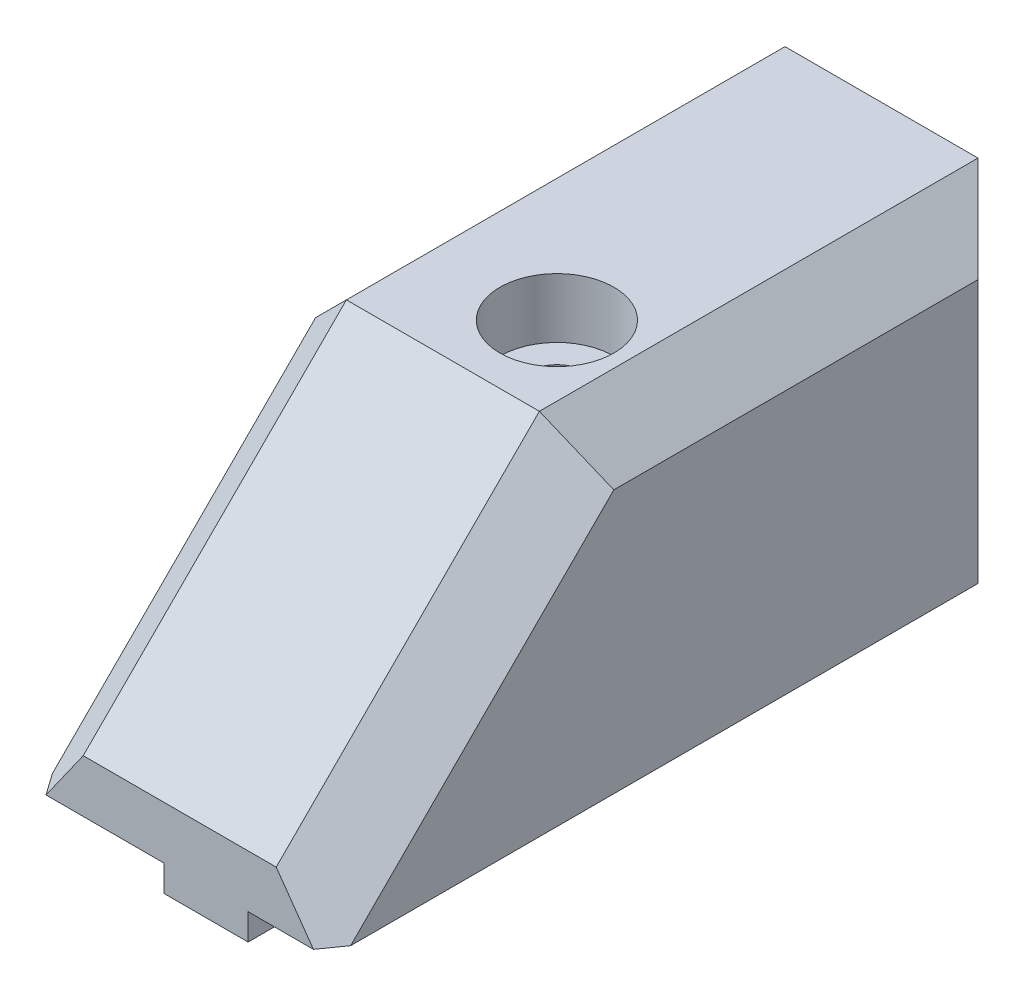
ISO-10303-21;
HEADER;
FILE_DESCRIPTION(('STEP AP214'),'2;1');
FILE_NAME('part.step','',(''),(''),'','','');
FILE_SCHEMA(('AUTOMOTIVE_DESIGN { 1 0 10303 214 1 1 1 1 }'));
ENDSEC;
DATA;
#1=APPLICATION_CONTEXT('core data for automotive mechanical design processes');
#2=APPLICATION_PROTOCOL_DEFINITION('international standard','automotive_design',2000,#1);
#3=PRODUCT_CONTEXT('',#1,'mechanical');
#4=PRODUCT('Part','Part','',(#3));
#5=PRODUCT_RELATED_PRODUCT_CATEGORY('part','',(#4));
#6=PRODUCT_DEFINITION_FORMATION('','',#4);
#7=PRODUCT_DEFINITION_CONTEXT('part definition',#1,'design');
#8=PRODUCT_DEFINITION('design','',#6,#7);
#9=PRODUCT_DEFINITION_SHAPE('','',#8);
#10=(LENGTH_UNIT() NAMED_UNIT(*) SI_UNIT(.MILLI.,.METRE.));
#11=(NAMED_UNIT(*) PLANE_ANGLE_UNIT() SI_UNIT($,.RADIAN.));
#12=(NAMED_UNIT(*) SI_UNIT($,.STERADIAN.) SOLID_ANGLE_UNIT());
#13=UNCERTAINTY_MEASURE_WITH_UNIT(LENGTH_MEASURE(1.E-05),#10,'distance_accuracy_value','');
#14=(GEOMETRIC_REPRESENTATION_CONTEXT(3) GLOBAL_UNCERTAINTY_ASSIGNED_CONTEXT((#13)) GLOBAL_UNIT_ASSIGNED_CONTEXT((#10,
#11,#12)) REPRESENTATION_CONTEXT('',''));
#15=CARTESIAN_POINT('',(0.,0.,0.));
#16=DIRECTION('',(0.,0.,1.));
#17=DIRECTION('',(1.,0.,0.));
#18=AXIS2_PLACEMENT_3D('',#15,#16,#17);
#19=CARTESIAN_POINT('',(17.,0.,0.));
#20=DIRECTION('',(0.,-1.,0.));
#21=DIRECTION('',(0.,0.,-1.));
#22=AXIS2_PLACEMENT_3D('',#19,#20,#21);
#23=PLANE('',#22);
#24=DIRECTION('',(0.,0.,1.));
#25=VECTOR('',#24,1.);
#26=CARTESIAN_POINT('',(25.5,0.,20.));
#27=LINE('',#26,#25);
#28=CARTESIAN_POINT('',(25.5,0.,-17.));
#29=VERTEX_POINT('',#28);
#30=CARTESIAN_POINT('',(25.5,0.,18.7573593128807));
#31=VERTEX_POINT('',#30);
#32=EDGE_CURVE('E189',#29,#31,#27,.T.);
#33=ORIENTED_EDGE('',*,*,#32,.T.);
#34=DIRECTION('',(-0.577350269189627,0.,0.816496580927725));
#35=VECTOR('',#34,1.);
#36=CARTESIAN_POINT('',(31.5089706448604,0.,10.2593915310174));
#37=LINE('',#36,#35);
#38=CARTESIAN_POINT('',(24.6213203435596,0.,20.));
#39=VERTEX_POINT('',#38);
#40=EDGE_CURVE('E207',#39,#31,#37,.F.);
#41=ORIENTED_EDGE('',*,*,#40,.F.);
#42=DIRECTION('',(-1.,0.,0.));
#43=VECTOR('',#42,1.);
#44=CARTESIAN_POINT('',(25.5,0.,20.));
#45=LINE('',#44,#43);
#46=CARTESIAN_POINT('',(20.9,0.,20.));
#47=VERTEX_POINT('',#46);
#48=EDGE_CURVE('E183',#39,#47,#45,.T.);
#49=ORIENTED_EDGE('',*,*,#48,.T.);
#50=DIRECTION('',(0.,0.,-1.));
#51=VECTOR('',#50,1.);
#52=CARTESIAN_POINT('',(20.9,0.,20.));
#53=LINE('',#52,#51);
#54=CARTESIAN_POINT('',(20.9,0.,-20.));
#55=VERTEX_POINT('',#54);
#56=EDGE_CURVE('E305',#47,#55,#53,.T.);
#57=ORIENTED_EDGE('',*,*,#56,.T.);
#58=DIRECTION('',(1.,0.,0.));
#59=VECTOR('',#58,1.);
#60=CARTESIAN_POINT('',(25.5,0.,-20.));
#61=LINE('',#60,#59);
#62=CARTESIAN_POINT('',(22.5,0.,-20.));
#63=VERTEX_POINT('',#62);
#64=EDGE_CURVE('E164',#55,#63,#61,.T.);
#65=ORIENTED_EDGE('',*,*,#64,.T.);
#66=DIRECTION('',(0.707106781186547,0.,0.707106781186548));
#67=VECTOR('',#66,1.);
#68=CARTESIAN_POINT('',(29.75,0.,-12.75));
#69=LINE('',#68,#67);
#70=EDGE_CURVE('E211',#29,#63,#69,.F.);
#71=ORIENTED_EDGE('',*,*,#70,.F.);
#72=EDGE_LOOP('',(#33,#41,#49,#57,#65,#71));
#73=FACE_BOUND('',#72,.T.);
#74=ADVANCED_FACE('F43',(#73),#23,.T.);
#75=CARTESIAN_POINT('',(8.5,18.,20.));
#76=DIRECTION('',(1.,0.,0.));
#77=DIRECTION('',(0.,0.,1.));
#78=AXIS2_PLACEMENT_3D('',#75,#76,#77);
#79=PLANE('',#78);
#80=DIRECTION('',(0.,0.,-1.));
#81=VECTOR('',#80,1.);
#82=CARTESIAN_POINT('',(8.5,0.,20.));
#83=LINE('',#82,#81);
#84=CARTESIAN_POINT('',(8.5,0.,18.7573593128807));
#85=VERTEX_POINT('',#84);
#86=CARTESIAN_POINT('',(8.5,0.,-17.));
#87=VERTEX_POINT('',#86);
#88=EDGE_CURVE('E167',#85,#87,#83,.T.);
#89=ORIENTED_EDGE('',*,*,#88,.F.);
#90=DIRECTION('',(0.,-0.707106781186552,0.707106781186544));
#91=VECTOR('',#90,1.);
#92=CARTESIAN_POINT('',(8.5,8.37867965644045,10.3786796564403));
#93=LINE('',#92,#91);
#94=CARTESIAN_POINT('',(8.5,15.,3.75735931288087));
#95=VERTEX_POINT('',#94);
#96=EDGE_CURVE('E53',#95,#85,#93,.T.);
#97=ORIENTED_EDGE('',*,*,#96,.F.);
#98=DIRECTION('',(0.,0.,1.));
#99=VECTOR('',#98,1.);
#100=CARTESIAN_POINT('',(8.5,15.,20.));
#101=LINE('',#100,#99);
#102=CARTESIAN_POINT('',(8.5,15.,-17.));
#103=VERTEX_POINT('',#102);
#104=EDGE_CURVE('E249',#103,#95,#101,.T.);
#105=ORIENTED_EDGE('',*,*,#104,.F.);
#106=DIRECTION('',(0.,1.,0.));
#107=VECTOR('',#106,1.);
#108=CARTESIAN_POINT('',(8.5,18.,-17.));
#109=LINE('',#108,#107);
#110=EDGE_CURVE('E11',#87,#103,#109,.T.);
#111=ORIENTED_EDGE('',*,*,#110,.F.);
#112=EDGE_LOOP('',(#89,#97,#105,#111));
#113=FACE_BOUND('',#112,.T.);
#114=ADVANCED_FACE('F363',(#113),#79,.F.);
#115=CARTESIAN_POINT('',(25.5,18.,-20.));
#116=DIRECTION('',(0.,0.,1.));
#117=DIRECTION('',(-1.,0.,0.));
#118=AXIS2_PLACEMENT_3D('',#115,#116,#117);
#119=PLANE('',#118);
#120=CARTESIAN_POINT('',(18.5,12.,-20.));
#121=DIRECTION('',(0.,0.,1.));
#122=DIRECTION('',(1.,0.,0.));
#123=AXIS2_PLACEMENT_3D('',#120,#121,#122);
#124=CIRCLE('',#123,2.8);
#125=CARTESIAN_POINT('',(21.3,12.,-20.));
#126=VERTEX_POINT('',#125);
#127=EDGE_CURVE('E275',#126,#126,#124,.T.);
#128=ORIENTED_EDGE('',*,*,#127,.T.);
#129=EDGE_LOOP('',(#128));
#130=FACE_BOUND('',#129,.T.);
#131=ORIENTED_EDGE('',*,*,#64,.F.);
#132=DIRECTION('',(0.,1.,0.));
#133=VECTOR('',#132,1.);
#134=CARTESIAN_POINT('',(20.9,-1.5,-20.));
#135=LINE('',#134,#133);
#136=CARTESIAN_POINT('',(20.9,-1.5,-20.));
#137=VERTEX_POINT('',#136);
#138=EDGE_CURVE('E144',#137,#55,#135,.T.);
#139=ORIENTED_EDGE('',*,*,#138,.F.);
#140=DIRECTION('',(-1.,0.,0.));
#141=VECTOR('',#140,1.);
#142=CARTESIAN_POINT('',(20.9,-1.5,-20.));
#143=LINE('',#142,#141);
#144=CARTESIAN_POINT('',(16.1,-1.5,-20.));
#145=VERTEX_POINT('',#144);
#146=EDGE_CURVE('E151',#137,#145,#143,.T.);
#147=ORIENTED_EDGE('',*,*,#146,.T.);
#148=DIRECTION('',(0.,1.,0.));
#149=VECTOR('',#148,1.);
#150=CARTESIAN_POINT('',(16.1,-1.5,-20.));
#151=LINE('',#150,#149);
#152=CARTESIAN_POINT('',(16.1,0.,-20.));
#153=VERTEX_POINT('',#152);
#154=EDGE_CURVE('E168',#145,#153,#151,.T.);
#155=ORIENTED_EDGE('',*,*,#154,.T.);
#156=CARTESIAN_POINT('',(11.5,0.,-20.));
#157=VERTEX_POINT('',#156);
#158=EDGE_CURVE('E185',#157,#153,#61,.T.);
#159=ORIENTED_EDGE('',*,*,#158,.F.);
#160=DIRECTION('',(0.,-1.,0.));
#161=VECTOR('',#160,1.);
#162=CARTESIAN_POINT('',(11.5,18.,-20.));
#163=LINE('',#162,#161);
#164=CARTESIAN_POINT('',(11.5,18.,-20.));
#165=VERTEX_POINT('',#164);
#166=EDGE_CURVE('E215',#165,#157,#163,.T.);
#167=ORIENTED_EDGE('',*,*,#166,.F.);
#168=DIRECTION('',(1.,0.,0.));
#169=VECTOR('',#168,1.);
#170=CARTESIAN_POINT('',(25.5,18.,-20.));
#171=LINE('',#170,#169);
#172=CARTESIAN_POINT('',(22.5,18.,-20.));
#173=VERTEX_POINT('',#172);
#174=EDGE_CURVE('E179',#165,#173,#171,.T.);
#175=ORIENTED_EDGE('',*,*,#174,.T.);
#176=DIRECTION('',(0.,1.,0.));
#177=VECTOR('',#176,1.);
#178=CARTESIAN_POINT('',(22.5,18.,-20.));
#179=LINE('',#178,#177);
#180=EDGE_CURVE('E219',#63,#173,#179,.T.);
#181=ORIENTED_EDGE('',*,*,#180,.F.);
#182=EDGE_LOOP('',(#131,#139,#147,#155,#159,#167,#175,#181));
#183=FACE_BOUND('',#182,.T.);
#184=ADVANCED_FACE('F162',(#130,#183),#119,.F.);
#185=CARTESIAN_POINT('',(25.5,18.,20.));
#186=DIRECTION('',(-1.,0.,0.));
#187=DIRECTION('',(0.,0.,-1.));
#188=AXIS2_PLACEMENT_3D('',#185,#186,#187);
#189=PLANE('',#188);
#190=DIRECTION('',(0.,0.,-1.));
#191=VECTOR('',#190,1.);
#192=CARTESIAN_POINT('',(25.5,15.,20.));
#193=LINE('',#192,#191);
#194=CARTESIAN_POINT('',(25.5,15.,3.75735931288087));
#195=VERTEX_POINT('',#194);
#196=CARTESIAN_POINT('',(25.5,15.,-17.));
#197=VERTEX_POINT('',#196);
#198=EDGE_CURVE('E182',#195,#197,#193,.T.);
#199=ORIENTED_EDGE('',*,*,#198,.F.);
#200=DIRECTION('',(0.,0.707106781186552,-0.707106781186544));
#201=VECTOR('',#200,1.);
#202=CARTESIAN_POINT('',(25.5,8.37867965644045,10.3786796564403));
#203=LINE('',#202,#201);
#204=EDGE_CURVE('E200',#31,#195,#203,.T.);
#205=ORIENTED_EDGE('',*,*,#204,.F.);
#206=ORIENTED_EDGE('',*,*,#32,.F.);
#207=DIRECTION('',(0.,-1.,0.));
#208=VECTOR('',#207,1.);
#209=CARTESIAN_POINT('',(25.5,18.,-17.));
#210=LINE('',#209,#208);
#211=EDGE_CURVE('E204',#197,#29,#210,.T.);
#212=ORIENTED_EDGE('',*,*,#211,.F.);
#213=EDGE_LOOP('',(#199,#205,#206,#212));
#214=FACE_BOUND('',#213,.T.);
#215=ADVANCED_FACE('F379',(#214),#189,.F.);
#216=CARTESIAN_POINT('',(25.5,18.,20.));
#217=DIRECTION('',(0.,0.,-1.));
#218=DIRECTION('',(1.,0.,0.));
#219=AXIS2_PLACEMENT_3D('',#216,#217,#218);
#220=PLANE('',#219);
#221=DIRECTION('',(-1.,0.,0.));
#222=VECTOR('',#221,1.);
#223=CARTESIAN_POINT('',(25.5,3.,20.));
#224=LINE('',#223,#222);
#225=CARTESIAN_POINT('',(22.5,3.,20.));
#226=VERTEX_POINT('',#225);
#227=CARTESIAN_POINT('',(11.5,3.,20.));
#228=VERTEX_POINT('',#227);
#229=EDGE_CURVE('E259',#226,#228,#224,.T.);
#230=ORIENTED_EDGE('',*,*,#229,.T.);
#231=DIRECTION('',(-0.577350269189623,-0.816496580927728,0.));
#232=VECTOR('',#231,1.);
#233=CARTESIAN_POINT('',(11.5,3.,20.));
#234=LINE('',#233,#232);
#235=CARTESIAN_POINT('',(9.37867965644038,0.,20.));
#236=VERTEX_POINT('',#235);
#237=EDGE_CURVE('E229',#236,#228,#234,.F.);
#238=ORIENTED_EDGE('',*,*,#237,.F.);
#239=CARTESIAN_POINT('',(16.1,0.,20.));
#240=VERTEX_POINT('',#239);
#241=EDGE_CURVE('E193',#240,#236,#45,.T.);
#242=ORIENTED_EDGE('',*,*,#241,.F.);
#243=DIRECTION('',(0.,1.,0.));
#244=VECTOR('',#243,1.);
#245=CARTESIAN_POINT('',(16.1,-1.5,20.));
#246=LINE('',#245,#244);
#247=CARTESIAN_POINT('',(16.1,-1.5,20.));
#248=VERTEX_POINT('',#247);
#249=EDGE_CURVE('E175',#248,#240,#246,.T.);
#250=ORIENTED_EDGE('',*,*,#249,.F.);
#251=DIRECTION('',(1.,0.,0.));
#252=VECTOR('',#251,1.);
#253=CARTESIAN_POINT('',(20.9,-1.5,20.));
#254=LINE('',#253,#252);
#255=CARTESIAN_POINT('',(20.9,-1.5,20.));
#256=VERTEX_POINT('',#255);
#257=EDGE_CURVE('E317',#248,#256,#254,.T.);
#258=ORIENTED_EDGE('',*,*,#257,.T.);
#259=DIRECTION('',(0.,1.,0.));
#260=VECTOR('',#259,1.);
#261=CARTESIAN_POINT('',(20.9,-1.5,20.));
#262=LINE('',#261,#260);
#263=EDGE_CURVE('E146',#256,#47,#262,.T.);
#264=ORIENTED_EDGE('',*,*,#263,.T.);
#265=ORIENTED_EDGE('',*,*,#48,.F.);
#266=DIRECTION('',(-0.577350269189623,0.816496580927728,0.));
#267=VECTOR('',#266,1.);
#268=CARTESIAN_POINT('',(20.9644660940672,5.17157287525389,20.));
#269=LINE('',#268,#267);
#270=EDGE_CURVE('E233',#226,#39,#269,.F.);
#271=ORIENTED_EDGE('',*,*,#270,.F.);
#272=EDGE_LOOP('',(#230,#238,#242,#250,#258,#264,#265,#271));
#273=FACE_BOUND('',#272,.T.);
#274=ADVANCED_FACE('F335',(#273),#220,.F.);
#275=CARTESIAN_POINT('',(17.,18.,0.));
#276=DIRECTION('',(0.,-1.,0.));
#277=DIRECTION('',(0.,0.,-1.));
#278=AXIS2_PLACEMENT_3D('',#275,#276,#277);
#279=PLANE('',#278);
#280=CARTESIAN_POINT('',(18.5,18.,0.));
#281=DIRECTION('',(0.,-1.,0.));
#282=DIRECTION('',(0.,0.,1.));
#283=AXIS2_PLACEMENT_3D('',#280,#281,#282);
#284=CIRCLE('',#283,3.25);
#285=CARTESIAN_POINT('',(18.5,18.,3.25));
#286=VERTEX_POINT('',#285);
#287=EDGE_CURVE('E285',#286,#286,#284,.T.);
#288=ORIENTED_EDGE('',*,*,#287,.T.);
#289=EDGE_LOOP('',(#288));
#290=FACE_BOUND('',#289,.T.);
#291=ORIENTED_EDGE('',*,*,#174,.F.);
#292=DIRECTION('',(0.,0.,-1.));
#293=VECTOR('',#292,1.);
#294=CARTESIAN_POINT('',(11.5,18.,0.));
#295=LINE('',#294,#293);
#296=CARTESIAN_POINT('',(11.5,18.,5.00000000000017));
#297=VERTEX_POINT('',#296);
#298=EDGE_CURVE('E236',#297,#165,#295,.T.);
#299=ORIENTED_EDGE('',*,*,#298,.F.);
#300=DIRECTION('',(-1.,0.,0.));
#301=VECTOR('',#300,1.);
#302=CARTESIAN_POINT('',(25.5,18.,5.00000000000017));
#303=LINE('',#302,#301);
#304=CARTESIAN_POINT('',(22.5,18.,5.00000000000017));
#305=VERTEX_POINT('',#304);
#306=EDGE_CURVE('E270',#305,#297,#303,.T.);
#307=ORIENTED_EDGE('',*,*,#306,.F.);
#308=DIRECTION('',(0.,0.,1.));
#309=VECTOR('',#308,1.);
#310=CARTESIAN_POINT('',(22.5,18.,0.));
#311=LINE('',#310,#309);
#312=EDGE_CURVE('E239',#173,#305,#311,.T.);
#313=ORIENTED_EDGE('',*,*,#312,.F.);
#314=EDGE_LOOP('',(#291,#299,#307,#313));
#315=FACE_BOUND('',#314,.T.);
#316=ADVANCED_FACE('F372',(#290,#315),#279,.F.);
#317=ORIENTED_EDGE('',*,*,#158,.T.);
#318=DIRECTION('',(0.,0.,1.));
#319=VECTOR('',#318,1.);
#320=CARTESIAN_POINT('',(16.1,0.,20.));
#321=LINE('',#320,#319);
#322=EDGE_CURVE('E152',#153,#240,#321,.T.);
#323=ORIENTED_EDGE('',*,*,#322,.T.);
#324=ORIENTED_EDGE('',*,*,#241,.T.);
#325=DIRECTION('',(-0.577350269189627,0.,-0.816496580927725));
#326=VECTOR('',#325,1.);
#327=CARTESIAN_POINT('',(2.49102935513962,0.,10.2593915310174));
#328=LINE('',#327,#326);
#329=EDGE_CURVE('E243',#85,#236,#328,.F.);
#330=ORIENTED_EDGE('',*,*,#329,.F.);
#331=ORIENTED_EDGE('',*,*,#88,.T.);
#332=DIRECTION('',(0.707106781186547,0.,-0.707106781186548));
#333=VECTOR('',#332,1.);
#334=CARTESIAN_POINT('',(4.25,0.,-12.75));
#335=LINE('',#334,#333);
#336=EDGE_CURVE('E246',#157,#87,#335,.F.);
#337=ORIENTED_EDGE('',*,*,#336,.F.);
#338=EDGE_LOOP('',(#317,#323,#324,#330,#331,#337));
#339=FACE_BOUND('',#338,.T.);
#340=ADVANCED_FACE('F360',(#339),#23,.T.);
#341=CARTESIAN_POINT('',(20.9,-1.5,20.));
#342=DIRECTION('',(-1.,0.,0.));
#343=DIRECTION('',(0.,0.,-1.));
#344=AXIS2_PLACEMENT_3D('',#341,#342,#343);
#345=PLANE('',#344);
#346=ORIENTED_EDGE('',*,*,#56,.F.);
#347=ORIENTED_EDGE('',*,*,#263,.F.);
#348=DIRECTION('',(0.,0.,-1.));
#349=VECTOR('',#348,1.);
#350=CARTESIAN_POINT('',(20.9,-1.5,20.));
#351=LINE('',#350,#349);
#352=EDGE_CURVE('E139',#256,#137,#351,.T.);
#353=ORIENTED_EDGE('',*,*,#352,.T.);
#354=ORIENTED_EDGE('',*,*,#138,.T.);
#355=EDGE_LOOP('',(#346,#347,#353,#354));
#356=FACE_BOUND('',#355,.T.);
#357=ADVANCED_FACE('F142',(#356),#345,.F.);
#358=CARTESIAN_POINT('',(16.1,-1.5,20.));
#359=DIRECTION('',(1.,0.,0.));
#360=DIRECTION('',(0.,0.,1.));
#361=AXIS2_PLACEMENT_3D('',#358,#359,#360);
#362=PLANE('',#361);
#363=ORIENTED_EDGE('',*,*,#322,.F.);
#364=ORIENTED_EDGE('',*,*,#154,.F.);
#365=DIRECTION('',(0.,0.,1.));
#366=VECTOR('',#365,1.);
#367=CARTESIAN_POINT('',(16.1,-1.5,20.));
#368=LINE('',#367,#366);
#369=EDGE_CURVE('E156',#145,#248,#368,.T.);
#370=ORIENTED_EDGE('',*,*,#369,.T.);
#371=ORIENTED_EDGE('',*,*,#249,.T.);
#372=EDGE_LOOP('',(#363,#364,#370,#371));
#373=FACE_BOUND('',#372,.T.);
#374=ADVANCED_FACE('F331',(#373),#362,.F.);
#375=CARTESIAN_POINT('',(17.,-1.5,0.));
#376=DIRECTION('',(0.,-1.,0.));
#377=DIRECTION('',(0.,0.,-1.));
#378=AXIS2_PLACEMENT_3D('',#375,#376,#377);
#379=PLANE('',#378);
#380=CARTESIAN_POINT('',(18.5,-1.5,0.));
#381=DIRECTION('',(0.,-1.,0.));
#382=DIRECTION('',(0.,0.,1.));
#383=AXIS2_PLACEMENT_3D('',#380,#381,#382);
#384=CIRCLE('',#383,1.7);
#385=CARTESIAN_POINT('',(18.5,-1.5,1.7));
#386=VERTEX_POINT('',#385);
#387=EDGE_CURVE('E300',#386,#386,#384,.T.);
#388=ORIENTED_EDGE('',*,*,#387,.F.);
#389=EDGE_LOOP('',(#388));
#390=FACE_BOUND('',#389,.T.);
#391=ORIENTED_EDGE('',*,*,#352,.F.);
#392=ORIENTED_EDGE('',*,*,#257,.F.);
#393=ORIENTED_EDGE('',*,*,#369,.F.);
#394=ORIENTED_EDGE('',*,*,#146,.F.);
#395=EDGE_LOOP('',(#391,#392,#393,#394));
#396=FACE_BOUND('',#395,.T.);
#397=ADVANCED_FACE('F155',(#390,#396),#379,.T.);
#398=CARTESIAN_POINT('',(18.5,18.,0.));
#399=DIRECTION('',(0.,1.,0.));
#400=DIRECTION('',(0.,0.,1.));
#401=AXIS2_PLACEMENT_3D('',#398,#399,#400);
#402=CYLINDRICAL_SURFACE('',#401,1.7);
#403=ORIENTED_EDGE('',*,*,#387,.T.);
#404=EDGE_LOOP('',(#403));
#405=FACE_BOUND('',#404,.T.);
#406=CARTESIAN_POINT('',(18.5,14.6,0.));
#407=DIRECTION('',(0.,-1.,0.));
#408=DIRECTION('',(0.,0.,1.));
#409=AXIS2_PLACEMENT_3D('',#406,#407,#408);
#410=CIRCLE('',#409,1.70000000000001);
#411=CARTESIAN_POINT('',(18.5,14.6,1.70000000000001));
#412=VERTEX_POINT('',#411);
#413=EDGE_CURVE('E295',#412,#412,#410,.T.);
#414=ORIENTED_EDGE('',*,*,#413,.F.);
#415=EDGE_LOOP('',(#414));
#416=FACE_BOUND('',#415,.T.);
#417=ADVANCED_FACE('F415',(#405,#416),#402,.F.);
#418=CARTESIAN_POINT('',(16.8,14.6,0.));
#419=DIRECTION('',(0.,-1.,0.));
#420=DIRECTION('',(0.,0.,-1.));
#421=AXIS2_PLACEMENT_3D('',#418,#419,#420);
#422=PLANE('',#421);
#423=ORIENTED_EDGE('',*,*,#413,.T.);
#424=EDGE_LOOP('',(#423));
#425=FACE_BOUND('',#424,.T.);
#426=CARTESIAN_POINT('',(18.5,14.6,0.));
#427=DIRECTION('',(0.,-1.,0.));
#428=DIRECTION('',(0.,0.,1.));
#429=AXIS2_PLACEMENT_3D('',#426,#427,#428);
#430=CIRCLE('',#429,3.25);
#431=CARTESIAN_POINT('',(18.5,14.6,3.25));
#432=VERTEX_POINT('',#431);
#433=EDGE_CURVE('E290',#432,#432,#430,.T.);
#434=ORIENTED_EDGE('',*,*,#433,.F.);
#435=EDGE_LOOP('',(#434));
#436=FACE_BOUND('',#435,.T.);
#437=ADVANCED_FACE('F419',(#425,#436),#422,.F.);
#438=CARTESIAN_POINT('',(18.5,18.,0.));
#439=DIRECTION('',(0.,1.,0.));
#440=DIRECTION('',(0.,0.,1.));
#441=AXIS2_PLACEMENT_3D('',#438,#439,#440);
#442=CYLINDRICAL_SURFACE('',#441,3.25);
#443=ORIENTED_EDGE('',*,*,#433,.T.);
#444=EDGE_LOOP('',(#443));
#445=FACE_BOUND('',#444,.T.);
#446=ORIENTED_EDGE('',*,*,#287,.F.);
#447=EDGE_LOOP('',(#446));
#448=FACE_BOUND('',#447,.T.);
#449=ADVANCED_FACE('F423',(#445,#448),#442,.F.);
#450=CARTESIAN_POINT('',(18.5,12.,-5.));
#451=DIRECTION('',(0.,0.,1.));
#452=DIRECTION('',(-1.,0.,0.));
#453=AXIS2_PLACEMENT_3D('',#450,#451,#452);
#454=PLANE('',#453);
#455=CARTESIAN_POINT('',(18.5,12.,-5.));
#456=DIRECTION('',(0.,0.,1.));
#457=DIRECTION('',(1.,0.,0.));
#458=AXIS2_PLACEMENT_3D('',#455,#456,#457);
#459=CIRCLE('',#458,2.8);
#460=CARTESIAN_POINT('',(21.3,12.,-5.));
#461=VERTEX_POINT('',#460);
#462=EDGE_CURVE('E280',#461,#461,#459,.T.);
#463=ORIENTED_EDGE('',*,*,#462,.F.);
#464=EDGE_LOOP('',(#463));
#465=FACE_BOUND('',#464,.T.);
#466=ADVANCED_FACE('F427',(#465),#454,.F.);
#467=CARTESIAN_POINT('',(18.5,12.,-20.));
#468=DIRECTION('',(0.,0.,-1.));
#469=DIRECTION('',(1.,0.,0.));
#470=AXIS2_PLACEMENT_3D('',#467,#468,#469);
#471=CYLINDRICAL_SURFACE('',#470,2.8);
#472=ORIENTED_EDGE('',*,*,#462,.T.);
#473=EDGE_LOOP('',(#472));
#474=FACE_BOUND('',#473,.T.);
#475=ORIENTED_EDGE('',*,*,#127,.F.);
#476=EDGE_LOOP('',(#475));
#477=FACE_BOUND('',#476,.T.);
#478=ADVANCED_FACE('F389',(#474,#477),#471,.F.);
#479=CARTESIAN_POINT('',(25.5,3.,20.));
#480=DIRECTION('',(0.,-0.707106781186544,-0.707106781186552));
#481=DIRECTION('',(0.,0.707106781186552,-0.707106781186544));
#482=AXIS2_PLACEMENT_3D('',#479,#480,#481);
#483=PLANE('',#482);
#484=ORIENTED_EDGE('',*,*,#306,.T.);
#485=DIRECTION('',(0.,0.707106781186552,-0.707106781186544));
#486=VECTOR('',#485,1.);
#487=CARTESIAN_POINT('',(11.5,3.,20.));
#488=LINE('',#487,#486);
#489=EDGE_CURVE('E223',#228,#297,#488,.T.);
#490=ORIENTED_EDGE('',*,*,#489,.F.);
#491=ORIENTED_EDGE('',*,*,#229,.F.);
#492=DIRECTION('',(0.,-0.707106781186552,0.707106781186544));
#493=VECTOR('',#492,1.);
#494=CARTESIAN_POINT('',(22.5,3.,20.));
#495=LINE('',#494,#493);
#496=EDGE_CURVE('E226',#305,#226,#495,.T.);
#497=ORIENTED_EDGE('',*,*,#496,.F.);
#498=EDGE_LOOP('',(#484,#490,#491,#497));
#499=FACE_BOUND('',#498,.T.);
#500=ADVANCED_FACE('F355',(#499),#483,.F.);
#501=CARTESIAN_POINT('',(25.5,8.37867965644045,10.3786796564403));
#502=DIRECTION('',(-0.707106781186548,-0.499999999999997,-0.500000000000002));
#503=DIRECTION('',(0.,0.707106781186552,-0.707106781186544));
#504=AXIS2_PLACEMENT_3D('',#501,#502,#503);
#505=PLANE('',#504);
#506=ORIENTED_EDGE('',*,*,#270,.T.);
#507=ORIENTED_EDGE('',*,*,#40,.T.);
#508=ORIENTED_EDGE('',*,*,#204,.T.);
#509=DIRECTION('',(-0.678598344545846,0.678598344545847,0.281084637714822));
#510=VECTOR('',#509,1.);
#511=CARTESIAN_POINT('',(23.4537178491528,17.0462821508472,4.60495713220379));
#512=LINE('',#511,#510);
#513=EDGE_CURVE('E257',#195,#305,#512,.T.);
#514=ORIENTED_EDGE('',*,*,#513,.T.);
#515=ORIENTED_EDGE('',*,*,#496,.T.);
#516=EDGE_LOOP('',(#506,#507,#508,#514,#515));
#517=FACE_BOUND('',#516,.T.);
#518=ADVANCED_FACE('F381',(#517),#505,.F.);
#519=CARTESIAN_POINT('',(22.5,18.,0.));
#520=DIRECTION('',(-0.707106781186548,-0.707106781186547,0.));
#521=DIRECTION('',(0.,0.,1.));
#522=AXIS2_PLACEMENT_3D('',#519,#520,#521);
#523=PLANE('',#522);
#524=ORIENTED_EDGE('',*,*,#513,.F.);
#525=ORIENTED_EDGE('',*,*,#198,.T.);
#526=DIRECTION('',(0.577350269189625,-0.577350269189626,0.577350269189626));
#527=VECTOR('',#526,1.);
#528=CARTESIAN_POINT('',(29.1666666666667,11.3333333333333,-13.3333333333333));
#529=LINE('',#528,#527);
#530=EDGE_CURVE('E254',#197,#173,#529,.F.);
#531=ORIENTED_EDGE('',*,*,#530,.T.);
#532=ORIENTED_EDGE('',*,*,#312,.T.);
#533=EDGE_LOOP('',(#524,#525,#531,#532));
#534=FACE_BOUND('',#533,.T.);
#535=ADVANCED_FACE('F380',(#534),#523,.F.);
#536=CARTESIAN_POINT('',(25.5,18.,-17.));
#537=DIRECTION('',(-0.707106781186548,0.,0.707106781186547));
#538=DIRECTION('',(0.,-1.,0.));
#539=AXIS2_PLACEMENT_3D('',#536,#537,#538);
#540=PLANE('',#539);
#541=ORIENTED_EDGE('',*,*,#530,.F.);
#542=ORIENTED_EDGE('',*,*,#211,.T.);
#543=ORIENTED_EDGE('',*,*,#70,.T.);
#544=ORIENTED_EDGE('',*,*,#180,.T.);
#545=EDGE_LOOP('',(#541,#542,#543,#544));
#546=FACE_BOUND('',#545,.T.);
#547=ADVANCED_FACE('F375',(#546),#540,.F.);
#548=CARTESIAN_POINT('',(11.5,3.,20.));
#549=DIRECTION('',(0.707106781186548,-0.499999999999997,-0.500000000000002));
#550=DIRECTION('',(0.,0.707106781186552,-0.707106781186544));
#551=AXIS2_PLACEMENT_3D('',#548,#549,#550);
#552=PLANE('',#551);
#553=ORIENTED_EDGE('',*,*,#329,.T.);
#554=ORIENTED_EDGE('',*,*,#237,.T.);
#555=ORIENTED_EDGE('',*,*,#489,.T.);
#556=DIRECTION('',(-0.678598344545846,-0.678598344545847,-0.281084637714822));
#557=VECTOR('',#556,1.);
#558=CARTESIAN_POINT('',(10.5462821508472,17.0462821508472,4.60495713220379));
#559=LINE('',#558,#557);
#560=EDGE_CURVE('E47',#297,#95,#559,.T.);
#561=ORIENTED_EDGE('',*,*,#560,.T.);
#562=ORIENTED_EDGE('',*,*,#96,.T.);
#563=EDGE_LOOP('',(#553,#554,#555,#561,#562));
#564=FACE_BOUND('',#563,.T.);
#565=ADVANCED_FACE('F45',(#564),#552,.F.);
#566=CARTESIAN_POINT('',(11.5,18.,0.));
#567=DIRECTION('',(0.707106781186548,-0.707106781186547,0.));
#568=DIRECTION('',(0.,0.,-1.));
#569=AXIS2_PLACEMENT_3D('',#566,#567,#568);
#570=PLANE('',#569);
#571=ORIENTED_EDGE('',*,*,#560,.F.);
#572=ORIENTED_EDGE('',*,*,#298,.T.);
#573=DIRECTION('',(0.577350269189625,0.577350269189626,-0.577350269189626));
#574=VECTOR('',#573,1.);
#575=CARTESIAN_POINT('',(4.83333333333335,11.3333333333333,-13.3333333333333));
#576=LINE('',#575,#574);
#577=EDGE_CURVE('E67',#165,#103,#576,.F.);
#578=ORIENTED_EDGE('',*,*,#577,.T.);
#579=ORIENTED_EDGE('',*,*,#104,.T.);
#580=EDGE_LOOP('',(#571,#572,#578,#579));
#581=FACE_BOUND('',#580,.T.);
#582=ADVANCED_FACE('F451',(#581),#570,.F.);
#583=CARTESIAN_POINT('',(11.5,18.,-20.));
#584=DIRECTION('',(0.707106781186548,0.,0.707106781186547));
#585=DIRECTION('',(0.,-1.,0.));
#586=AXIS2_PLACEMENT_3D('',#583,#584,#585);
#587=PLANE('',#586);
#588=ORIENTED_EDGE('',*,*,#577,.F.);
#589=ORIENTED_EDGE('',*,*,#166,.T.);
#590=ORIENTED_EDGE('',*,*,#336,.T.);
#591=ORIENTED_EDGE('',*,*,#110,.T.);
#592=EDGE_LOOP('',(#588,#589,#590,#591));
#593=FACE_BOUND('',#592,.T.);
#594=ADVANCED_FACE('F366',(#593),#587,.F.);
#595=CLOSED_SHELL('',(#74,#114,#184,#215,#274,#316,#340,#357,#374,#397,#417,#437,#449,#466,#478,
#500,#518,#535,#547,#565,#582,#594));
#596=MANIFOLD_SOLID_BREP('B2',#595);
#597=ADVANCED_BREP_SHAPE_REPRESENTATION('',(#18,#596),#14);
#598=SHAPE_DEFINITION_REPRESENTATION(#9,#597);
ENDSEC;
END-ISO-10303-21;
